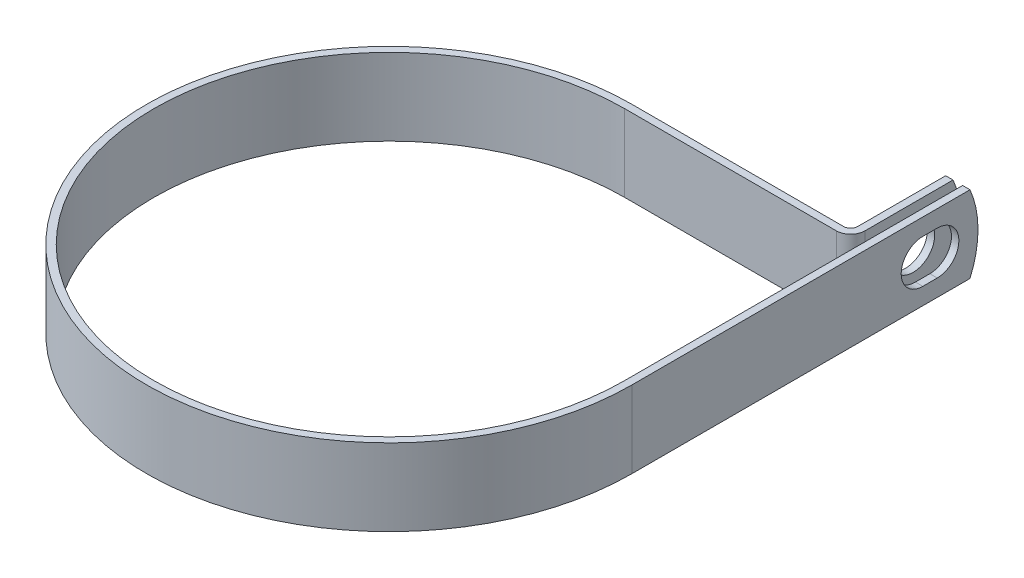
from build123d import *

# Parameters (mm, degrees)
EXTRUDE_THIN1_DEPTH = 6.35
SKETCH2_R           = 3.5687
CUT_EXTRUDE1_DEPTH  = 1.2192
CUT_EXTRUDE2_REACH  = 100.68
CUT_EXTRUDE3_DEPTH  = 96.446227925


with BuildPart() as part:
    # Sketch1 → Extrude-Thin1 (new, symmetric)
    with BuildSketch(Plane(origin=(0, 0, 0), x_dir=(1, 0, 0), z_dir=(0, 1, 0))):
        with BuildLine():
            Line((38.8874, 57.1246), (38.8874, 38.8874))
            Line((38.8874, 38.8874), (38.8874, 0))
            ThreePointArc((38.8874, 0), (-27.497544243, -27.497544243), (0, 38.8874))
            Line((0, 38.8874), (34.93516, 38.8874))
            ThreePointArc((34.93516, 38.8874), (36.616263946, 39.583736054), (37.3126, 41.26484))
            Line((37.3126, 41.26484), (37.3126, 57.1246))
            Line((37.3126, 57.1246), (36.0934, 57.1246))
            Line((36.0934, 57.1246), (36.0934, 41.26484))
            ThreePointArc((36.0934, 41.26484), (35.754159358, 40.445840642), (34.93516, 40.1066))
            Line((34.93516, 40.1066), (0, 40.1066))
            ThreePointArc((0, 40.1066), (-28.35964883, -28.35964883), (40.1066, 0))
            Line((40.1066, 0), (40.1066, 38.8874))
            Line((40.1066, 38.8874), (40.1066, 57.1246))
            Line((40.1066, 57.1246), (38.8874, 57.1246))
        make_face()
    extrude(amount=EXTRUDE_THIN1_DEPTH, both=True)

    # Sketch2 → Cut-Extrude1 (cut)
    with BuildSketch(Plane.ZY.offset(-36.0934)):
        with Locations((-49.1998, 0)):
            Circle(SKETCH2_R)
    extrude(amount=-CUT_EXTRUDE1_DEPTH, mode=Mode.SUBTRACT)

    # Sketch3 → Cut-Extrude2 (cut, up to next)
    with BuildSketch(Plane(origin=(40.1066, 0, 0), x_dir=(0, 0, -1), z_dir=(1, 0, 0)), mode=Mode.PRIVATE) as cut_extrude2_sk1:
        with BuildLine():
            Line((48.006, 3.5687), (50.3936, 3.5687))
            ThreePointArc((50.3936, 3.5687), (53.9623, 0), (50.3936, -3.5687))
            Line((50.3936, -3.5687), (48.006, -3.5687))
            ThreePointArc((48.006, -3.5687), (44.4373, 0), (48.006, 3.5687))
        make_face()
    cut_extrude2_tool1 = extrude(cut_extrude2_sk1.sketch, amount=-CUT_EXTRUDE2_REACH, mode=Mode.PRIVATE) & part.part
    add(cut_extrude2_tool1.solids().sort_by_distance((40.1066, 0, -49.1998))[0], mode=Mode.SUBTRACT)

    # Sketch4 → Cut-Extrude3 (cut, through all)
    with BuildSketch(Plane.ZY.offset(-36.0934)):
        with BuildLine():
            Line((-55.799277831, 6.35), (-57.1246, 6.35))
            Line((-57.1246, 6.35), (-57.1246, 0))
            ThreePointArc((-57.1246, 0), (-56.789737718, 3.243415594), (-55.799277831, 6.35))
        make_face()
        with BuildLine():
            ThreePointArc((-55.799277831, -6.35), (-56.789737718, -3.243415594), (-57.1246, 0))
            Line((-57.1246, 0), (-57.1246, -6.35))
            Line((-57.1246, -6.35), (-55.799277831, -6.35))
        make_face()
    extrude(amount=-CUT_EXTRUDE3_DEPTH, mode=Mode.SUBTRACT)


solid = part.part
